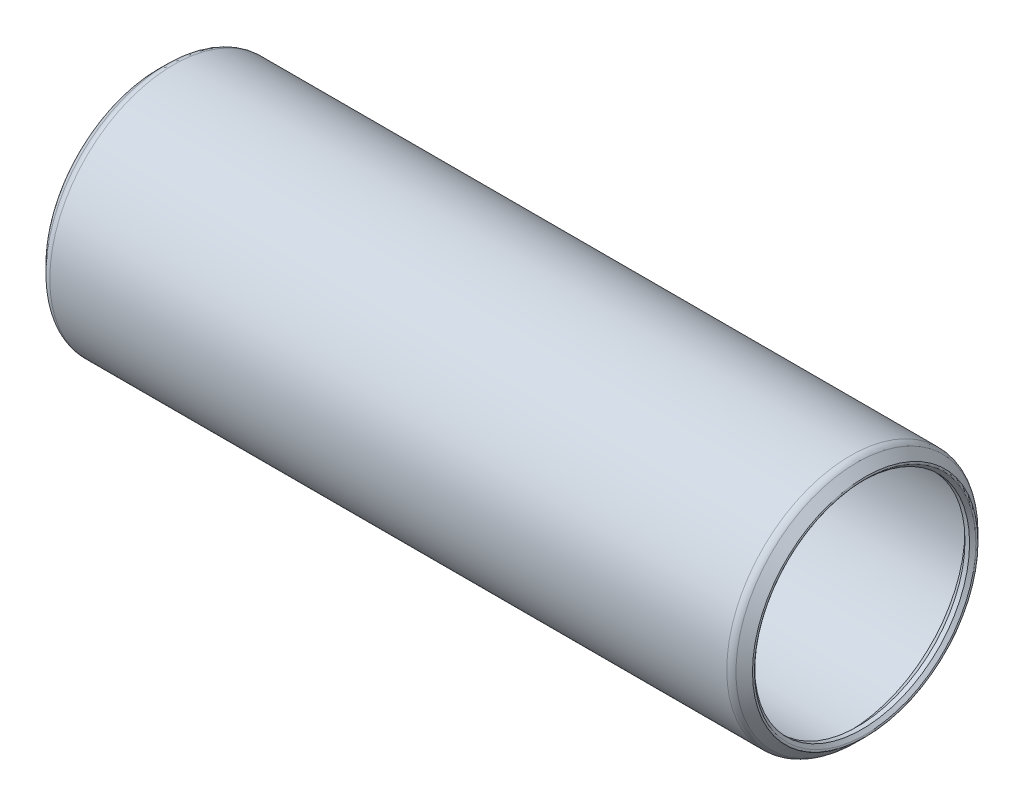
ISO-10303-21;
HEADER;
FILE_DESCRIPTION(('STEP AP214'),'2;1');
FILE_NAME('part.step','',(''),(''),'','','');
FILE_SCHEMA(('AUTOMOTIVE_DESIGN { 1 0 10303 214 1 1 1 1 }'));
ENDSEC;
DATA;
#1=APPLICATION_CONTEXT('core data for automotive mechanical design processes');
#2=APPLICATION_PROTOCOL_DEFINITION('international standard','automotive_design',2000,#1);
#3=PRODUCT_CONTEXT('',#1,'mechanical');
#4=PRODUCT('Part','Part','',(#3));
#5=PRODUCT_RELATED_PRODUCT_CATEGORY('part','',(#4));
#6=PRODUCT_DEFINITION_FORMATION('','',#4);
#7=PRODUCT_DEFINITION_CONTEXT('part definition',#1,'design');
#8=PRODUCT_DEFINITION('design','',#6,#7);
#9=PRODUCT_DEFINITION_SHAPE('','',#8);
#10=(LENGTH_UNIT() NAMED_UNIT(*) SI_UNIT(.MILLI.,.METRE.));
#11=(NAMED_UNIT(*) PLANE_ANGLE_UNIT() SI_UNIT($,.RADIAN.));
#12=(NAMED_UNIT(*) SI_UNIT($,.STERADIAN.) SOLID_ANGLE_UNIT());
#13=UNCERTAINTY_MEASURE_WITH_UNIT(LENGTH_MEASURE(1.E-05),#10,'distance_accuracy_value','');
#14=(GEOMETRIC_REPRESENTATION_CONTEXT(3) GLOBAL_UNCERTAINTY_ASSIGNED_CONTEXT((#13)) GLOBAL_UNIT_ASSIGNED_CONTEXT((#10,
#11,#12)) REPRESENTATION_CONTEXT('',''));
#15=CARTESIAN_POINT('',(0.,0.,0.));
#16=DIRECTION('',(0.,0.,1.));
#17=DIRECTION('',(1.,0.,0.));
#18=AXIS2_PLACEMENT_3D('',#15,#16,#17);
#19=CARTESIAN_POINT('',(57.2897,0.,0.));
#20=DIRECTION('',(-1.,0.,0.));
#21=DIRECTION('',(0.,0.,1.));
#22=AXIS2_PLACEMENT_3D('',#19,#20,#21);
#23=CYLINDRICAL_SURFACE('',#22,9.67105);
#24=CARTESIAN_POINT('',(0.762000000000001,0.,0.));
#25=DIRECTION('',(1.,0.,0.));
#26=DIRECTION('',(0.,0.,-1.));
#27=AXIS2_PLACEMENT_3D('',#24,#25,#26);
#28=CIRCLE('',#27,9.67105);
#29=CARTESIAN_POINT('',(0.762,0.,-9.67105));
#30=VERTEX_POINT('',#29);
#31=EDGE_CURVE('E125',#30,#30,#28,.F.);
#32=ORIENTED_EDGE('',*,*,#31,.T.);
#33=EDGE_LOOP('',(#32));
#34=FACE_BOUND('',#33,.T.);
#35=CARTESIAN_POINT('',(56.5277,0.,0.));
#36=DIRECTION('',(-1.,0.,0.));
#37=DIRECTION('',(0.,0.,1.));
#38=AXIS2_PLACEMENT_3D('',#35,#36,#37);
#39=CIRCLE('',#38,9.67105);
#40=CARTESIAN_POINT('',(56.5277,0.,9.67105));
#41=VERTEX_POINT('',#40);
#42=EDGE_CURVE('E120',#41,#41,#39,.F.);
#43=ORIENTED_EDGE('',*,*,#42,.T.);
#44=EDGE_LOOP('',(#43));
#45=FACE_BOUND('',#44,.T.);
#46=ADVANCED_FACE('F23',(#34,#45),#23,.F.);
#47=CARTESIAN_POINT('',(0.762,0.,0.));
#48=DIRECTION('',(1.,0.,0.));
#49=DIRECTION('',(0.,0.,-1.));
#50=AXIS2_PLACEMENT_3D('',#47,#48,#49);
#51=CONICAL_SURFACE('',#50,9.67105,0.785398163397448);
#52=CARTESIAN_POINT('',(0.,0.,0.));
#53=DIRECTION('',(-1.,0.,0.));
#54=DIRECTION('',(0.,0.,1.));
#55=AXIS2_PLACEMENT_3D('',#52,#53,#54);
#56=CIRCLE('',#55,8.90905);
#57=CARTESIAN_POINT('',(0.,0.,8.90905));
#58=VERTEX_POINT('',#57);
#59=EDGE_CURVE('E115',#58,#58,#56,.T.);
#60=ORIENTED_EDGE('',*,*,#59,.T.);
#61=EDGE_LOOP('',(#60));
#62=FACE_BOUND('',#61,.T.);
#63=ORIENTED_EDGE('',*,*,#31,.F.);
#64=EDGE_LOOP('',(#63));
#65=FACE_BOUND('',#64,.T.);
#66=ADVANCED_FACE('F132',(#62,#65),#51,.F.);
#67=CARTESIAN_POINT('',(56.5277,0.,0.));
#68=DIRECTION('',(-1.,0.,0.));
#69=DIRECTION('',(0.,0.,1.));
#70=AXIS2_PLACEMENT_3D('',#67,#68,#69);
#71=CONICAL_SURFACE('',#70,9.67105,0.785398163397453);
#72=ORIENTED_EDGE('',*,*,#42,.F.);
#73=EDGE_LOOP('',(#72));
#74=FACE_BOUND('',#73,.T.);
#75=CARTESIAN_POINT('',(57.2897,0.,0.));
#76=DIRECTION('',(-1.,0.,0.));
#77=DIRECTION('',(0.,0.,1.));
#78=AXIS2_PLACEMENT_3D('',#75,#76,#77);
#79=CIRCLE('',#78,8.90905);
#80=CARTESIAN_POINT('',(57.2897,0.,8.90905));
#81=VERTEX_POINT('',#80);
#82=EDGE_CURVE('E110',#81,#81,#79,.F.);
#83=ORIENTED_EDGE('',*,*,#82,.T.);
#84=EDGE_LOOP('',(#83));
#85=FACE_BOUND('',#84,.T.);
#86=ADVANCED_FACE('F134',(#74,#85),#71,.F.);
#87=CARTESIAN_POINT('',(57.2897,0.,0.));
#88=DIRECTION('',(-1.,0.,0.));
#89=DIRECTION('',(0.,0.,1.));
#90=AXIS2_PLACEMENT_3D('',#87,#88,#89);
#91=CYLINDRICAL_SURFACE('',#90,8.90905);
#92=CARTESIAN_POINT('',(-0.380999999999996,0.,0.));
#93=DIRECTION('',(-1.,0.,0.));
#94=DIRECTION('',(0.,0.,1.));
#95=AXIS2_PLACEMENT_3D('',#92,#93,#94);
#96=CIRCLE('',#95,8.90905);
#97=CARTESIAN_POINT('',(-0.380999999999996,0.,8.90905));
#98=VERTEX_POINT('',#97);
#99=EDGE_CURVE('E105',#98,#98,#96,.T.);
#100=ORIENTED_EDGE('',*,*,#99,.T.);
#101=EDGE_LOOP('',(#100));
#102=FACE_BOUND('',#101,.T.);
#103=ORIENTED_EDGE('',*,*,#59,.F.);
#104=EDGE_LOOP('',(#103));
#105=FACE_BOUND('',#104,.T.);
#106=ADVANCED_FACE('F141',(#102,#105),#91,.F.);
#107=CARTESIAN_POINT('',(57.2897,0.,0.));
#108=DIRECTION('',(-1.,0.,0.));
#109=DIRECTION('',(0.,0.,1.));
#110=AXIS2_PLACEMENT_3D('',#107,#108,#109);
#111=CYLINDRICAL_SURFACE('',#110,8.90905);
#112=ORIENTED_EDGE('',*,*,#82,.F.);
#113=EDGE_LOOP('',(#112));
#114=FACE_BOUND('',#113,.T.);
#115=CARTESIAN_POINT('',(57.6707,0.,0.));
#116=DIRECTION('',(1.,0.,0.));
#117=DIRECTION('',(0.,0.,-1.));
#118=AXIS2_PLACEMENT_3D('',#115,#116,#117);
#119=CIRCLE('',#118,8.90905);
#120=CARTESIAN_POINT('',(57.6707,0.,-8.90905));
#121=VERTEX_POINT('',#120);
#122=EDGE_CURVE('E100',#121,#121,#119,.T.);
#123=ORIENTED_EDGE('',*,*,#122,.T.);
#124=EDGE_LOOP('',(#123));
#125=FACE_BOUND('',#124,.T.);
#126=ADVANCED_FACE('F161',(#114,#125),#111,.F.);
#127=CARTESIAN_POINT('',(-0.639512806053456,0.,0.));
#128=DIRECTION('',(-1.,0.,0.));
#129=DIRECTION('',(0.,0.,1.));
#130=AXIS2_PLACEMENT_3D('',#127,#128,#129);
#131=CONICAL_SURFACE('',#130,9.16756280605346,0.785398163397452);
#132=CARTESIAN_POINT('',(-0.639512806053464,0.,0.));
#133=DIRECTION('',(1.,0.,0.));
#134=DIRECTION('',(0.,0.,-1.));
#135=AXIS2_PLACEMENT_3D('',#132,#133,#134);
#136=CIRCLE('',#135,9.16756280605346);
#137=CARTESIAN_POINT('',(-0.639512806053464,0.,-9.16756280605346));
#138=VERTEX_POINT('',#137);
#139=EDGE_CURVE('E97',#138,#138,#136,.T.);
#140=ORIENTED_EDGE('',*,*,#139,.F.);
#141=EDGE_LOOP('',(#140));
#142=FACE_BOUND('',#141,.T.);
#143=ORIENTED_EDGE('',*,*,#99,.F.);
#144=EDGE_LOOP('',(#143));
#145=FACE_BOUND('',#144,.T.);
#146=ADVANCED_FACE('F158',(#142,#145),#131,.F.);
#147=CARTESIAN_POINT('',(57.9292128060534,0.,0.));
#148=DIRECTION('',(1.,0.,0.));
#149=DIRECTION('',(0.,0.,-1.));
#150=AXIS2_PLACEMENT_3D('',#147,#148,#149);
#151=CONICAL_SURFACE('',#150,9.16756280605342,0.785398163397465);
#152=ORIENTED_EDGE('',*,*,#122,.F.);
#153=EDGE_LOOP('',(#152));
#154=FACE_BOUND('',#153,.T.);
#155=CARTESIAN_POINT('',(57.9292128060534,0.,0.));
#156=DIRECTION('',(1.,0.,0.));
#157=DIRECTION('',(0.,0.,-1.));
#158=AXIS2_PLACEMENT_3D('',#155,#156,#157);
#159=CIRCLE('',#158,9.16756280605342);
#160=CARTESIAN_POINT('',(57.9292128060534,0.,-9.16756280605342));
#161=VERTEX_POINT('',#160);
#162=EDGE_CURVE('E75',#161,#161,#159,.F.);
#163=ORIENTED_EDGE('',*,*,#162,.F.);
#164=EDGE_LOOP('',(#163));
#165=FACE_BOUND('',#164,.T.);
#166=ADVANCED_FACE('F91',(#154,#165),#151,.F.);
#167=CARTESIAN_POINT('',(-0.549710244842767,0.,0.));
#168=DIRECTION('',(1.,0.,0.));
#169=DIRECTION('',(0.,0.,-1.));
#170=AXIS2_PLACEMENT_3D('',#167,#168,#169);
#171=TOROIDAL_SURFACE('',#170,9.25736536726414,0.126999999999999);
#172=CARTESIAN_POINT('',(-0.639512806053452,0.,0.));
#173=DIRECTION('',(1.,0.,0.));
#174=DIRECTION('',(0.,0.,-1.));
#175=AXIS2_PLACEMENT_3D('',#172,#173,#174);
#176=CIRCLE('',#175,9.34716792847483);
#177=CARTESIAN_POINT('',(-0.639512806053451,0.,-9.34716792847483));
#178=VERTEX_POINT('',#177);
#179=EDGE_CURVE('E70',#178,#178,#176,.T.);
#180=ORIENTED_EDGE('',*,*,#179,.F.);
#181=EDGE_LOOP('',(#180));
#182=FACE_BOUND('',#181,.T.);
#183=ORIENTED_EDGE('',*,*,#139,.T.);
#184=EDGE_LOOP('',(#183));
#185=FACE_BOUND('',#184,.T.);
#186=ADVANCED_FACE('F86',(#182,#185),#171,.T.);
#187=CARTESIAN_POINT('',(57.8394102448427,0.,0.));
#188=DIRECTION('',(1.,0.,0.));
#189=DIRECTION('',(0.,0.,-1.));
#190=AXIS2_PLACEMENT_3D('',#187,#188,#189);
#191=TOROIDAL_SURFACE('',#190,9.25736536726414,0.127000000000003);
#192=ORIENTED_EDGE('',*,*,#162,.T.);
#193=EDGE_LOOP('',(#192));
#194=FACE_BOUND('',#193,.T.);
#195=CARTESIAN_POINT('',(57.9292128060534,0.,0.));
#196=DIRECTION('',(-1.,0.,0.));
#197=DIRECTION('',(0.,0.,1.));
#198=AXIS2_PLACEMENT_3D('',#195,#196,#197);
#199=CIRCLE('',#198,9.34716792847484);
#200=CARTESIAN_POINT('',(57.9292128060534,0.,9.34716792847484));
#201=VERTEX_POINT('',#200);
#202=EDGE_CURVE('E65',#201,#201,#199,.T.);
#203=ORIENTED_EDGE('',*,*,#202,.F.);
#204=EDGE_LOOP('',(#203));
#205=FACE_BOUND('',#204,.T.);
#206=ADVANCED_FACE('F82',(#194,#205),#191,.T.);
#207=CARTESIAN_POINT('',(0.0453846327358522,0.,0.));
#208=DIRECTION('',(1.,0.,0.));
#209=DIRECTION('',(0.,0.,-1.));
#210=AXIS2_PLACEMENT_3D('',#207,#208,#209);
#211=CONICAL_SURFACE('',#210,10.0320653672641,0.78539816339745);
#212=CARTESIAN_POINT('',(0.0453846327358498,0.,0.));
#213=DIRECTION('',(1.,0.,0.));
#214=DIRECTION('',(0.,0.,-1.));
#215=AXIS2_PLACEMENT_3D('',#212,#213,#214);
#216=CIRCLE('',#215,10.0320653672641);
#217=CARTESIAN_POINT('',(0.0453846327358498,0.,-10.0320653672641));
#218=VERTEX_POINT('',#217);
#219=EDGE_CURVE('E62',#218,#218,#216,.T.);
#220=ORIENTED_EDGE('',*,*,#219,.F.);
#221=EDGE_LOOP('',(#220));
#222=FACE_BOUND('',#221,.T.);
#223=ORIENTED_EDGE('',*,*,#179,.T.);
#224=EDGE_LOOP('',(#223));
#225=FACE_BOUND('',#224,.T.);
#226=ADVANCED_FACE('F85',(#222,#225),#211,.T.);
#227=CARTESIAN_POINT('',(57.2443153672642,0.,0.));
#228=DIRECTION('',(-1.,0.,0.));
#229=DIRECTION('',(0.,0.,1.));
#230=AXIS2_PLACEMENT_3D('',#227,#228,#229);
#231=CONICAL_SURFACE('',#230,10.032065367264,0.785398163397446);
#232=ORIENTED_EDGE('',*,*,#202,.T.);
#233=EDGE_LOOP('',(#232));
#234=FACE_BOUND('',#233,.T.);
#235=CARTESIAN_POINT('',(57.2443153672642,0.,0.));
#236=DIRECTION('',(1.,0.,0.));
#237=DIRECTION('',(0.,0.,-1.));
#238=AXIS2_PLACEMENT_3D('',#235,#236,#237);
#239=CIRCLE('',#238,10.0320653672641);
#240=CARTESIAN_POINT('',(57.2443153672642,0.,-10.0320653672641));
#241=VERTEX_POINT('',#240);
#242=EDGE_CURVE('E35',#241,#241,#239,.F.);
#243=ORIENTED_EDGE('',*,*,#242,.F.);
#244=EDGE_LOOP('',(#243));
#245=FACE_BOUND('',#244,.T.);
#246=ADVANCED_FACE('F56',(#234,#245),#231,.T.);
#247=CARTESIAN_POINT('',(0.584199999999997,0.,0.));
#248=DIRECTION('',(1.,0.,0.));
#249=DIRECTION('',(0.,0.,-1.));
#250=AXIS2_PLACEMENT_3D('',#247,#248,#249);
#251=TOROIDAL_SURFACE('',#250,9.49325,0.761999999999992);
#252=CARTESIAN_POINT('',(0.584200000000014,0.,0.));
#253=DIRECTION('',(-1.,0.,0.));
#254=DIRECTION('',(0.,0.,1.));
#255=AXIS2_PLACEMENT_3D('',#252,#253,#254);
#256=CIRCLE('',#255,10.25525);
#257=CARTESIAN_POINT('',(0.584200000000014,0.,10.25525));
#258=VERTEX_POINT('',#257);
#259=EDGE_CURVE('E30',#258,#258,#256,.F.);
#260=ORIENTED_EDGE('',*,*,#259,.F.);
#261=EDGE_LOOP('',(#260));
#262=FACE_BOUND('',#261,.T.);
#263=ORIENTED_EDGE('',*,*,#219,.T.);
#264=EDGE_LOOP('',(#263));
#265=FACE_BOUND('',#264,.T.);
#266=ADVANCED_FACE('F51',(#262,#265),#251,.T.);
#267=CARTESIAN_POINT('',(56.7055,0.,0.));
#268=DIRECTION('',(1.,0.,0.));
#269=DIRECTION('',(0.,0.,-1.));
#270=AXIS2_PLACEMENT_3D('',#267,#268,#269);
#271=TOROIDAL_SURFACE('',#270,9.49325000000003,0.761999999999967);
#272=ORIENTED_EDGE('',*,*,#242,.T.);
#273=EDGE_LOOP('',(#272));
#274=FACE_BOUND('',#273,.T.);
#275=CARTESIAN_POINT('',(56.7055,0.,0.));
#276=DIRECTION('',(-1.,0.,0.));
#277=DIRECTION('',(0.,0.,1.));
#278=AXIS2_PLACEMENT_3D('',#275,#276,#277);
#279=CIRCLE('',#278,10.25525);
#280=CARTESIAN_POINT('',(56.7055,0.,10.25525));
#281=VERTEX_POINT('',#280);
#282=EDGE_CURVE('E12',#281,#281,#279,.T.);
#283=ORIENTED_EDGE('',*,*,#282,.F.);
#284=EDGE_LOOP('',(#283));
#285=FACE_BOUND('',#284,.T.);
#286=ADVANCED_FACE('F46',(#274,#285),#271,.T.);
#287=CARTESIAN_POINT('',(57.2897,0.,0.));
#288=DIRECTION('',(-1.,0.,0.));
#289=DIRECTION('',(0.,0.,1.));
#290=AXIS2_PLACEMENT_3D('',#287,#288,#289);
#291=CYLINDRICAL_SURFACE('',#290,10.25525);
#292=ORIENTED_EDGE('',*,*,#282,.T.);
#293=EDGE_LOOP('',(#292));
#294=FACE_BOUND('',#293,.T.);
#295=ORIENTED_EDGE('',*,*,#259,.T.);
#296=EDGE_LOOP('',(#295));
#297=FACE_BOUND('',#296,.T.);
#298=ADVANCED_FACE('F50',(#294,#297),#291,.T.);
#299=CLOSED_SHELL('',(#46,#66,#86,#106,#126,#146,#166,#186,#206,#226,#246,#266,#286,#298));
#300=MANIFOLD_SOLID_BREP('B1',#299);
#301=ADVANCED_BREP_SHAPE_REPRESENTATION('',(#18,#300),#14);
#302=SHAPE_DEFINITION_REPRESENTATION(#9,#301);
ENDSEC;
END-ISO-10303-21;
